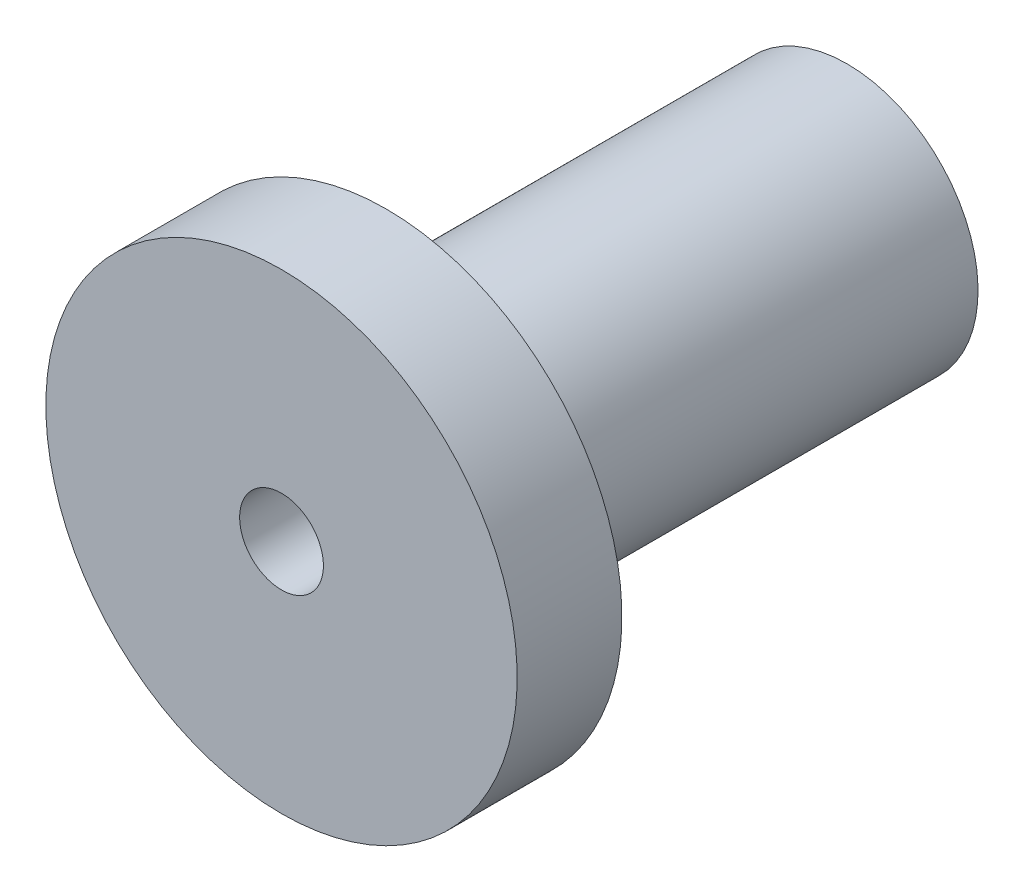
ISO-10303-21;
HEADER;
FILE_DESCRIPTION(('STEP AP214'),'2;1');
FILE_NAME('part.step','',(''),(''),'','','');
FILE_SCHEMA(('AUTOMOTIVE_DESIGN { 1 0 10303 214 1 1 1 1 }'));
ENDSEC;
DATA;
#1=APPLICATION_CONTEXT('core data for automotive mechanical design processes');
#2=APPLICATION_PROTOCOL_DEFINITION('international standard','automotive_design',2000,#1);
#3=PRODUCT_CONTEXT('',#1,'mechanical');
#4=PRODUCT('Part','Part','',(#3));
#5=PRODUCT_RELATED_PRODUCT_CATEGORY('part','',(#4));
#6=PRODUCT_DEFINITION_FORMATION('','',#4);
#7=PRODUCT_DEFINITION_CONTEXT('part definition',#1,'design');
#8=PRODUCT_DEFINITION('design','',#6,#7);
#9=PRODUCT_DEFINITION_SHAPE('','',#8);
#10=(LENGTH_UNIT() NAMED_UNIT(*) SI_UNIT(.MILLI.,.METRE.));
#11=(NAMED_UNIT(*) PLANE_ANGLE_UNIT() SI_UNIT($,.RADIAN.));
#12=(NAMED_UNIT(*) SI_UNIT($,.STERADIAN.) SOLID_ANGLE_UNIT());
#13=UNCERTAINTY_MEASURE_WITH_UNIT(LENGTH_MEASURE(1.E-05),#10,'distance_accuracy_value','');
#14=(GEOMETRIC_REPRESENTATION_CONTEXT(3) GLOBAL_UNCERTAINTY_ASSIGNED_CONTEXT((#13)) GLOBAL_UNIT_ASSIGNED_CONTEXT((#10,
#11,#12)) REPRESENTATION_CONTEXT('',''));
#15=CARTESIAN_POINT('',(0.,0.,0.));
#16=DIRECTION('',(0.,0.,1.));
#17=DIRECTION('',(1.,0.,0.));
#18=AXIS2_PLACEMENT_3D('',#15,#16,#17);
#19=CARTESIAN_POINT('',(0.,0.,-44.));
#20=DIRECTION('',(0.,0.,-1.));
#21=DIRECTION('',(0.,1.,0.));
#22=AXIS2_PLACEMENT_3D('',#19,#20,#21);
#23=PLANE('',#22);
#24=CARTESIAN_POINT('',(0.,0.,-44.));
#25=DIRECTION('',(0.,0.,-1.));
#26=DIRECTION('',(0.,1.,0.));
#27=AXIS2_PLACEMENT_3D('',#24,#25,#26);
#28=CIRCLE('',#27,12.5);
#29=CARTESIAN_POINT('',(0.,12.5,-44.));
#30=VERTEX_POINT('',#29);
#31=EDGE_CURVE('E16',#30,#30,#28,.F.);
#32=ORIENTED_EDGE('',*,*,#31,.F.);
#33=EDGE_LOOP('',(#32));
#34=FACE_BOUND('',#33,.T.);
#35=ADVANCED_FACE('F12',(#34),#23,.T.);
#36=CARTESIAN_POINT('',(0.,0.,-44.));
#37=DIRECTION('',(0.,0.,-1.));
#38=DIRECTION('',(0.,1.,0.));
#39=AXIS2_PLACEMENT_3D('',#36,#37,#38);
#40=CYLINDRICAL_SURFACE('',#39,12.5);
#41=CARTESIAN_POINT('',(0.,0.,0.));
#42=DIRECTION('',(0.,0.,-1.));
#43=DIRECTION('',(0.,1.,0.));
#44=AXIS2_PLACEMENT_3D('',#41,#42,#43);
#45=CIRCLE('',#44,12.5);
#46=CARTESIAN_POINT('',(0.,12.5,0.));
#47=VERTEX_POINT('',#46);
#48=EDGE_CURVE('E32',#47,#47,#45,.F.);
#49=ORIENTED_EDGE('',*,*,#48,.F.);
#50=EDGE_LOOP('',(#49));
#51=FACE_BOUND('',#50,.T.);
#52=ORIENTED_EDGE('',*,*,#31,.T.);
#53=EDGE_LOOP('',(#52));
#54=FACE_BOUND('',#53,.T.);
#55=ADVANCED_FACE('F39',(#51,#54),#40,.T.);
#56=CARTESIAN_POINT('',(12.5,0.,0.));
#57=DIRECTION('',(0.,0.,-1.));
#58=DIRECTION('',(0.,1.,0.));
#59=AXIS2_PLACEMENT_3D('',#56,#57,#58);
#60=PLANE('',#59);
#61=ORIENTED_EDGE('',*,*,#48,.T.);
#62=EDGE_LOOP('',(#61));
#63=FACE_BOUND('',#62,.T.);
#64=CARTESIAN_POINT('',(0.,0.,0.));
#65=DIRECTION('',(0.,0.,-1.));
#66=DIRECTION('',(0.,1.,0.));
#67=AXIS2_PLACEMENT_3D('',#64,#65,#66);
#68=CIRCLE('',#67,22.5);
#69=CARTESIAN_POINT('',(0.,22.5,0.));
#70=VERTEX_POINT('',#69);
#71=EDGE_CURVE('E30',#70,#70,#68,.F.);
#72=ORIENTED_EDGE('',*,*,#71,.F.);
#73=EDGE_LOOP('',(#72));
#74=FACE_BOUND('',#73,.T.);
#75=ADVANCED_FACE('F48',(#63,#74),#60,.T.);
#76=CARTESIAN_POINT('',(0.,0.,0.));
#77=DIRECTION('',(0.,0.,-1.));
#78=DIRECTION('',(0.,1.,0.));
#79=AXIS2_PLACEMENT_3D('',#76,#77,#78);
#80=CYLINDRICAL_SURFACE('',#79,22.5);
#81=CARTESIAN_POINT('',(0.,0.,10.));
#82=DIRECTION('',(0.,0.,-1.));
#83=DIRECTION('',(0.,1.,0.));
#84=AXIS2_PLACEMENT_3D('',#81,#82,#83);
#85=CIRCLE('',#84,22.5);
#86=CARTESIAN_POINT('',(0.,22.5,10.));
#87=VERTEX_POINT('',#86);
#88=EDGE_CURVE('E25',#87,#87,#85,.F.);
#89=ORIENTED_EDGE('',*,*,#88,.F.);
#90=EDGE_LOOP('',(#89));
#91=FACE_BOUND('',#90,.T.);
#92=ORIENTED_EDGE('',*,*,#71,.T.);
#93=EDGE_LOOP('',(#92));
#94=FACE_BOUND('',#93,.T.);
#95=ADVANCED_FACE('F63',(#91,#94),#80,.T.);
#96=CARTESIAN_POINT('',(0.,0.,-24.));
#97=DIRECTION('',(0.,0.,1.));
#98=DIRECTION('',(0.,-1.,0.));
#99=AXIS2_PLACEMENT_3D('',#96,#97,#98);
#100=PLANE('',#99);
#101=CARTESIAN_POINT('',(0.,0.,-24.));
#102=DIRECTION('',(0.,0.,1.));
#103=DIRECTION('',(-1.,0.,0.));
#104=AXIS2_PLACEMENT_3D('',#101,#102,#103);
#105=CIRCLE('',#104,4.);
#106=CARTESIAN_POINT('',(-4.,0.,-24.));
#107=VERTEX_POINT('',#106);
#108=EDGE_CURVE('E20',#107,#107,#105,.F.);
#109=ORIENTED_EDGE('',*,*,#108,.F.);
#110=EDGE_LOOP('',(#109));
#111=FACE_BOUND('',#110,.T.);
#112=ADVANCED_FACE('F57',(#111),#100,.T.);
#113=CARTESIAN_POINT('',(22.5,0.,10.));
#114=DIRECTION('',(0.,0.,1.));
#115=DIRECTION('',(0.,-1.,0.));
#116=AXIS2_PLACEMENT_3D('',#113,#114,#115);
#117=PLANE('',#116);
#118=CARTESIAN_POINT('',(0.,0.,10.));
#119=DIRECTION('',(0.,0.,1.));
#120=DIRECTION('',(-1.,0.,0.));
#121=AXIS2_PLACEMENT_3D('',#118,#119,#120);
#122=CIRCLE('',#121,4.);
#123=CARTESIAN_POINT('',(-3.99999999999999,0.,10.));
#124=VERTEX_POINT('',#123);
#125=EDGE_CURVE('E8',#124,#124,#122,.T.);
#126=ORIENTED_EDGE('',*,*,#125,.F.);
#127=EDGE_LOOP('',(#126));
#128=FACE_BOUND('',#127,.T.);
#129=ORIENTED_EDGE('',*,*,#88,.T.);
#130=EDGE_LOOP('',(#129));
#131=FACE_BOUND('',#130,.T.);
#132=ADVANCED_FACE('F52',(#128,#131),#117,.T.);
#133=CARTESIAN_POINT('',(0.,0.,-24.));
#134=DIRECTION('',(0.,0.,1.));
#135=DIRECTION('',(-1.,0.,0.));
#136=AXIS2_PLACEMENT_3D('',#133,#134,#135);
#137=CYLINDRICAL_SURFACE('',#136,4.);
#138=ORIENTED_EDGE('',*,*,#125,.T.);
#139=EDGE_LOOP('',(#138));
#140=FACE_BOUND('',#139,.T.);
#141=ORIENTED_EDGE('',*,*,#108,.T.);
#142=EDGE_LOOP('',(#141));
#143=FACE_BOUND('',#142,.T.);
#144=ADVANCED_FACE('F14',(#140,#143),#137,.F.);
#145=CLOSED_SHELL('',(#35,#55,#75,#95,#112,#132,#144));
#146=MANIFOLD_SOLID_BREP('B1',#145);
#147=ADVANCED_BREP_SHAPE_REPRESENTATION('',(#18,#146),#14);
#148=SHAPE_DEFINITION_REPRESENTATION(#9,#147);
ENDSEC;
END-ISO-10303-21;
